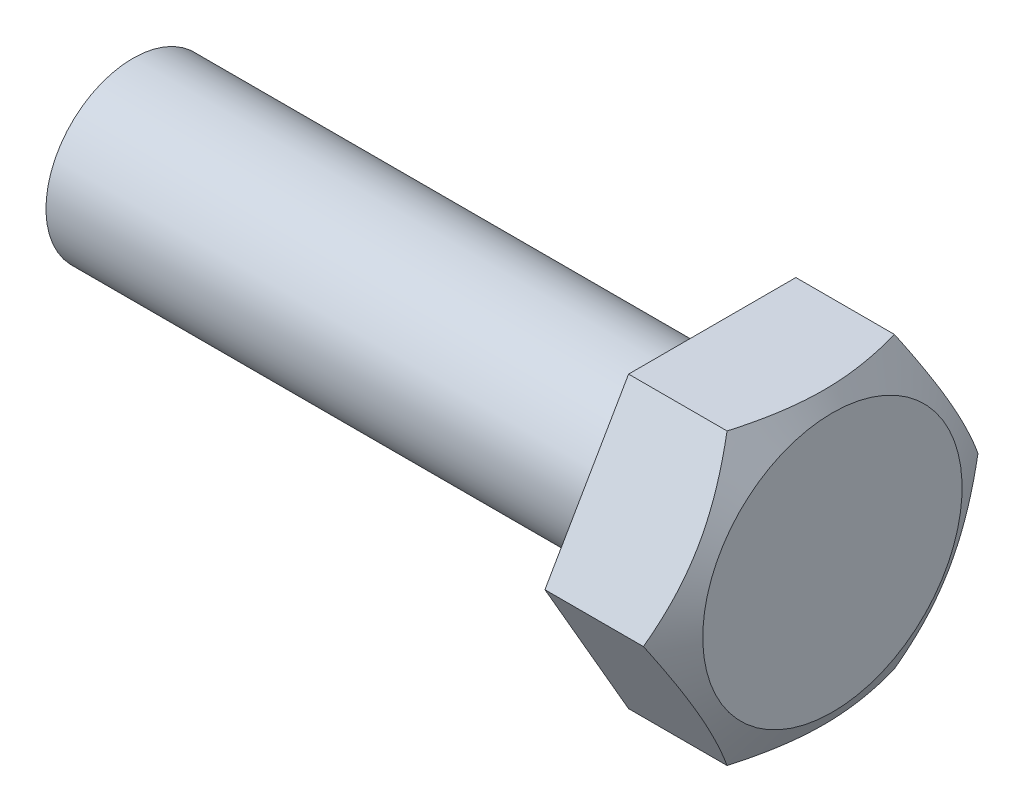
ISO-10303-21;
HEADER;
FILE_DESCRIPTION(('STEP AP214'),'2;1');
FILE_NAME('part.step','',(''),(''),'','','');
FILE_SCHEMA(('AUTOMOTIVE_DESIGN { 1 0 10303 214 1 1 1 1 }'));
ENDSEC;
DATA;
#1=APPLICATION_CONTEXT('core data for automotive mechanical design processes');
#2=APPLICATION_PROTOCOL_DEFINITION('international standard','automotive_design',2000,#1);
#3=PRODUCT_CONTEXT('',#1,'mechanical');
#4=PRODUCT('Part','Part','',(#3));
#5=PRODUCT_RELATED_PRODUCT_CATEGORY('part','',(#4));
#6=PRODUCT_DEFINITION_FORMATION('','',#4);
#7=PRODUCT_DEFINITION_CONTEXT('part definition',#1,'design');
#8=PRODUCT_DEFINITION('design','',#6,#7);
#9=PRODUCT_DEFINITION_SHAPE('','',#8);
#10=(LENGTH_UNIT() NAMED_UNIT(*) SI_UNIT(.MILLI.,.METRE.));
#11=(NAMED_UNIT(*) PLANE_ANGLE_UNIT() SI_UNIT($,.RADIAN.));
#12=(NAMED_UNIT(*) SI_UNIT($,.STERADIAN.) SOLID_ANGLE_UNIT());
#13=UNCERTAINTY_MEASURE_WITH_UNIT(LENGTH_MEASURE(1.E-05),#10,'distance_accuracy_value','');
#14=(GEOMETRIC_REPRESENTATION_CONTEXT(3) GLOBAL_UNCERTAINTY_ASSIGNED_CONTEXT((#13)) GLOBAL_UNIT_ASSIGNED_CONTEXT((#10,
#11,#12)) REPRESENTATION_CONTEXT('',''));
#15=CARTESIAN_POINT('',(0.,0.,0.));
#16=DIRECTION('',(0.,0.,1.));
#17=DIRECTION('',(1.,0.,0.));
#18=AXIS2_PLACEMENT_3D('',#15,#16,#17);
#19=CARTESIAN_POINT('',(20.,2.99999999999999,0.));
#20=DIRECTION('',(-1.,0.,0.));
#21=DIRECTION('',(0.,-1.,0.));
#22=AXIS2_PLACEMENT_3D('',#19,#20,#21);
#23=PLANE('',#22);
#24=CARTESIAN_POINT('',(20.,0.,0.));
#25=DIRECTION('',(1.,0.,0.));
#26=DIRECTION('',(0.,1.,0.));
#27=AXIS2_PLACEMENT_3D('',#24,#25,#26);
#28=CIRCLE('',#27,3.);
#29=CARTESIAN_POINT('',(20.,2.99999999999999,0.));
#30=VERTEX_POINT('',#29);
#31=EDGE_CURVE('E515',#30,#30,#28,.T.);
#32=ORIENTED_EDGE('',*,*,#31,.T.);
#33=EDGE_LOOP('',(#32));
#34=FACE_BOUND('',#33,.T.);
#35=DIRECTION('',(0.,-0.866025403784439,0.5));
#36=VECTOR('',#35,1.);
#37=CARTESIAN_POINT('',(20.,-0.250648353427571,-5.63028810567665));
#38=LINE('',#37,#36);
#39=CARTESIAN_POINT('',(20.,0.,-5.775));
#40=VERTEX_POINT('',#39);
#41=CARTESIAN_POINT('',(20.,-5.00129670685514,-2.88749999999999));
#42=VERTEX_POINT('',#41);
#43=EDGE_CURVE('E441',#40,#42,#38,.T.);
#44=ORIENTED_EDGE('',*,*,#43,.T.);
#45=DIRECTION('',(0.,0.,1.));
#46=VECTOR('',#45,1.);
#47=CARTESIAN_POINT('',(20.,-5.00129670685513,0.));
#48=LINE('',#47,#46);
#49=CARTESIAN_POINT('',(20.,-5.00129670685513,2.8875));
#50=VERTEX_POINT('',#49);
#51=EDGE_CURVE('E12',#42,#50,#48,.T.);
#52=ORIENTED_EDGE('',*,*,#51,.T.);
#53=DIRECTION('',(0.,0.866025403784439,0.5));
#54=VECTOR('',#53,1.);
#55=CARTESIAN_POINT('',(20.,-0.250648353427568,5.63028810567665));
#56=LINE('',#55,#54);
#57=CARTESIAN_POINT('',(20.,0.,5.775));
#58=VERTEX_POINT('',#57);
#59=EDGE_CURVE('E399',#50,#58,#56,.T.);
#60=ORIENTED_EDGE('',*,*,#59,.T.);
#61=DIRECTION('',(0.,0.866025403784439,-0.5));
#62=VECTOR('',#61,1.);
#63=CARTESIAN_POINT('',(20.,4.75064835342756,3.03221189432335));
#64=LINE('',#63,#62);
#65=CARTESIAN_POINT('',(20.,5.00129670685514,2.8875));
#66=VERTEX_POINT('',#65);
#67=EDGE_CURVE('E461',#58,#66,#64,.T.);
#68=ORIENTED_EDGE('',*,*,#67,.T.);
#69=DIRECTION('',(0.,0.,-1.));
#70=VECTOR('',#69,1.);
#71=CARTESIAN_POINT('',(20.,5.00129670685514,0.));
#72=LINE('',#71,#70);
#73=CARTESIAN_POINT('',(20.,5.00129670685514,-2.8875));
#74=VERTEX_POINT('',#73);
#75=EDGE_CURVE('E459',#66,#74,#72,.T.);
#76=ORIENTED_EDGE('',*,*,#75,.T.);
#77=DIRECTION('',(0.,-0.866025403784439,-0.5));
#78=VECTOR('',#77,1.);
#79=CARTESIAN_POINT('',(20.,4.75064835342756,-3.03221189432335));
#80=LINE('',#79,#78);
#81=EDGE_CURVE('E445',#74,#40,#80,.T.);
#82=ORIENTED_EDGE('',*,*,#81,.T.);
#83=EDGE_LOOP('',(#44,#52,#60,#68,#76,#82));
#84=FACE_BOUND('',#83,.T.);
#85=ADVANCED_FACE('F390',(#34,#84),#23,.T.);
#86=CARTESIAN_POINT('',(0.,0.,0.));
#87=DIRECTION('',(-1.,0.,0.));
#88=DIRECTION('',(0.,-1.,0.));
#89=AXIS2_PLACEMENT_3D('',#86,#87,#88);
#90=PLANE('',#89);
#91=CARTESIAN_POINT('',(0.,0.,0.));
#92=DIRECTION('',(1.,0.,0.));
#93=DIRECTION('',(0.,1.,0.));
#94=AXIS2_PLACEMENT_3D('',#91,#92,#93);
#95=CIRCLE('',#94,3.);
#96=CARTESIAN_POINT('',(0.,2.99999999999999,0.));
#97=VERTEX_POINT('',#96);
#98=EDGE_CURVE('E524',#97,#97,#95,.T.);
#99=ORIENTED_EDGE('',*,*,#98,.F.);
#100=EDGE_LOOP('',(#99));
#101=FACE_BOUND('',#100,.T.);
#102=ADVANCED_FACE('F556',(#101),#90,.T.);
#103=CARTESIAN_POINT('',(64.0534023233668,0.,0.));
#104=DIRECTION('',(1.,0.,0.));
#105=DIRECTION('',(0.,1.,0.));
#106=AXIS2_PLACEMENT_3D('',#103,#104,#105);
#107=CYLINDRICAL_SURFACE('',#106,3.);
#108=ORIENTED_EDGE('',*,*,#98,.T.);
#109=EDGE_LOOP('',(#108));
#110=FACE_BOUND('',#109,.T.);
#111=ORIENTED_EDGE('',*,*,#31,.F.);
#112=EDGE_LOOP('',(#111));
#113=FACE_BOUND('',#112,.T.);
#114=ADVANCED_FACE('F507',(#110,#113),#107,.T.);
#115=CARTESIAN_POINT('',(17.3428,-5.00129670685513,2.8875));
#116=DIRECTION('',(0.,-1.,0.));
#117=DIRECTION('',(0.,0.,-1.));
#118=AXIS2_PLACEMENT_3D('',#115,#116,#117);
#119=PLANE('',#118);
#120=DIRECTION('',(1.,0.,0.));
#121=VECTOR('',#120,1.);
#122=CARTESIAN_POINT('',(17.3428,-5.00129670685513,2.8875));
#123=LINE('',#122,#121);
#124=CARTESIAN_POINT('',(23.4,-5.00129670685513,2.8875));
#125=VERTEX_POINT('',#124);
#126=EDGE_CURVE('E471',#50,#125,#123,.T.);
#127=ORIENTED_EDGE('',*,*,#126,.F.);
#128=ORIENTED_EDGE('',*,*,#51,.F.);
#129=DIRECTION('',(1.,0.,0.));
#130=VECTOR('',#129,1.);
#131=CARTESIAN_POINT('',(17.3428,-5.00129670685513,-2.8875));
#132=LINE('',#131,#130);
#133=CARTESIAN_POINT('',(23.4,-5.00129670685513,-2.8875));
#134=VERTEX_POINT('',#133);
#135=EDGE_CURVE('E411',#42,#134,#132,.T.);
#136=ORIENTED_EDGE('',*,*,#135,.T.);
#137=CARTESIAN_POINT('',(21.4737240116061,-5.00129670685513,-7.6160872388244));
#138=CARTESIAN_POINT('',(21.5785707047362,-5.00129670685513,-7.39877070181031));
#139=CARTESIAN_POINT('',(21.6823706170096,-5.00129670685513,-7.18093993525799));
#140=CARTESIAN_POINT('',(21.8872850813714,-5.00129670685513,-6.74397588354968));
#141=CARTESIAN_POINT('',(21.9883991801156,-5.00129670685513,-6.5248423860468));
#142=CARTESIAN_POINT('',(22.1878893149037,-5.00129670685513,-6.08380103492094));
#143=CARTESIAN_POINT('',(22.2862461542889,-5.00129670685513,-5.86188446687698));
#144=CARTESIAN_POINT('',(22.4787424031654,-5.00129670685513,-5.41623629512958));
#145=CARTESIAN_POINT('',(22.572882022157,-5.00129670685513,-5.19250478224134));
#146=CARTESIAN_POINT('',(22.7585247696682,-5.00129670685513,-4.73623678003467));
#147=CARTESIAN_POINT('',(22.8498685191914,-5.00129670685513,-4.50363507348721));
#148=CARTESIAN_POINT('',(23.0252971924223,-5.00129670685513,-4.03565914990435));
#149=CARTESIAN_POINT('',(23.1093812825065,-5.00129670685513,-3.80028461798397));
#150=CARTESIAN_POINT('',(23.2679800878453,-5.00129670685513,-3.32687645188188));
#151=CARTESIAN_POINT('',(23.3425154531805,-5.00129670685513,-3.08884980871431));
#152=CARTESIAN_POINT('',(23.4795334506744,-5.00129670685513,-2.60938663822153));
#153=CARTESIAN_POINT('',(23.542020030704,-5.00129670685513,-2.36795125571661));
#154=CARTESIAN_POINT('',(23.6515306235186,-5.00129670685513,-1.8828327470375));
#155=CARTESIAN_POINT('',(23.6986321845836,-5.00129670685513,-1.63916746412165));
#156=CARTESIAN_POINT('',(23.7746117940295,-5.00129670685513,-1.14895991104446));
#157=CARTESIAN_POINT('',(23.8034912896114,-5.00129670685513,-0.90241787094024));
#158=CARTESIAN_POINT('',(23.8403434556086,-5.00129670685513,-0.410846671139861));
#159=CARTESIAN_POINT('',(23.8485737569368,-5.00129670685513,-0.165837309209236));
#160=CARTESIAN_POINT('',(23.8440998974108,-5.00129670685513,0.324005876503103));
#161=CARTESIAN_POINT('',(23.8313949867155,-5.00129670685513,0.568839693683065));
#162=CARTESIAN_POINT('',(23.7925261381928,-5.00129670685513,0.988769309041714));
#163=CARTESIAN_POINT('',(23.7710871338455,-5.00129670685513,1.16432588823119));
#164=CARTESIAN_POINT('',(23.7188586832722,-5.00129670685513,1.51405249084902));
#165=CARTESIAN_POINT('',(23.6880678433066,-5.00129670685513,1.6882223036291));
#166=CARTESIAN_POINT('',(23.5832970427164,-5.00129670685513,2.2084761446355));
#167=CARTESIAN_POINT('',(23.4969411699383,-5.00129670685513,2.55209019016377));
#168=CARTESIAN_POINT('',(23.3484847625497,-5.00129670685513,3.06574341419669));
#169=CARTESIAN_POINT('',(23.2951803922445,-5.00129670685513,3.23847506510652));
#170=CARTESIAN_POINT('',(23.1833585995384,-5.00129670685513,3.58225888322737));
#171=CARTESIAN_POINT('',(23.1248411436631,-5.00129670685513,3.75331103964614));
#172=CARTESIAN_POINT('',(23.0035050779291,-5.00129670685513,4.09379671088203));
#173=CARTESIAN_POINT('',(22.940688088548,-5.00129670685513,4.26323080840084));
#174=CARTESIAN_POINT('',(22.8114595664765,-5.00129670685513,4.60071709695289));
#175=CARTESIAN_POINT('',(22.7450480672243,-5.00129670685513,4.76876930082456));
#176=CARTESIAN_POINT('',(22.5902086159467,-5.00129670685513,5.15056016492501));
#177=CARTESIAN_POINT('',(22.500824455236,-5.00129670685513,5.3639101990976));
#178=CARTESIAN_POINT('',(22.3181437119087,-5.00129670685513,5.78893294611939));
#179=CARTESIAN_POINT('',(22.2248469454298,-5.00129670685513,6.00060557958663));
#180=CARTESIAN_POINT('',(22.0350910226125,-5.00129670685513,6.42256637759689));
#181=CARTESIAN_POINT('',(21.9386313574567,-5.00129670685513,6.63285431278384));
#182=CARTESIAN_POINT('',(21.7431477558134,-5.00129670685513,7.05223656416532));
#183=CARTESIAN_POINT('',(21.6441237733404,-5.00129670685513,7.26133085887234));
#184=CARTESIAN_POINT('',(21.3437507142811,-5.00129670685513,7.88746059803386));
#185=CARTESIAN_POINT('',(21.1392616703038,-5.00129670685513,8.30298898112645));
#186=CARTESIAN_POINT('',(20.7245178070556,-5.00129670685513,9.13115773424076));
#187=CARTESIAN_POINT('',(20.51426280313,-5.00129670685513,9.54379801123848));
#188=CARTESIAN_POINT('',(20.2040141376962,-5.00129670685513,10.1451524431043));
#189=CARTESIAN_POINT('',(20.1056567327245,-5.00129670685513,10.3347131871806));
#190=CARTESIAN_POINT('',(19.9081713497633,-5.00129670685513,10.7134289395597));
#191=CARTESIAN_POINT('',(19.8090433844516,-5.00129670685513,10.9025839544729));
#192=CARTESIAN_POINT('',(19.5106485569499,-5.00129670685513,11.4695336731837));
#193=CARTESIAN_POINT('',(19.3103775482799,-5.00129670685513,11.846799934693));
#194=CARTESIAN_POINT('',(18.908211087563,-5.00129670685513,12.5994260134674));
#195=CARTESIAN_POINT('',(18.7063200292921,-5.00129670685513,12.9747881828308));
#196=CARTESIAN_POINT('',(18.30091151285,-5.00129670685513,13.7246105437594));
#197=CARTESIAN_POINT('',(18.0973941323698,-5.00129670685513,14.0990707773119));
#198=CARTESIAN_POINT('',(17.8932640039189,-5.00129670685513,14.473194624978));
#199=B_SPLINE_CURVE_WITH_KNOTS('',3,(#137,#138,#139,#140,#141,#142,#143,#144,#145,#146,#147,
#148,#149,#150,#151,#152,#153,#154,#155,#156,#157,#158,#159,#160,#161,#162,#163,#164,#165,#166,
#167,#168,#169,#170,#171,#172,#173,#174,#175,#176,#177,#178,#179,#180,#181,#182,#183,#184,#185,
#186,#187,#188,#189,#190,#191,#192,#193,#194,#195,#196,#197,#198),.UNSPECIFIED.,.F.,.F.,(4,2,2,
2,2,2,2,2,2,2,2,2,2,2,2,2,2,2,2,2,2,2,2,2,2,2,2,2,2,2,4),(0.,0.723869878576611,1.44786117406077,
2.17603576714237,2.90417414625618,3.65376392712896,4.40343966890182,5.15146576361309,
5.89924634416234,6.64319738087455,7.38708932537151,8.12165284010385,8.85624266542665,
9.38656506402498,9.91696653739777,10.9784132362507,11.5206798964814,12.062950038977,
12.6050169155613,13.1470787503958,13.8409799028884,14.5349137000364,15.2289596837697,
15.9230181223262,17.3123013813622,18.7016291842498,19.3423047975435,19.9829698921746,
21.2643443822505,22.5429765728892,23.8215480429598),.UNSPECIFIED.);
#200=EDGE_CURVE('E478',#125,#134,#199,.F.);
#201=ORIENTED_EDGE('',*,*,#200,.F.);
#202=EDGE_LOOP('',(#127,#128,#136,#201));
#203=FACE_BOUND('',#202,.T.);
#204=ADVANCED_FACE('F476',(#203),#119,.T.);
#205=CARTESIAN_POINT('',(17.3428,0.,5.775));
#206=DIRECTION('',(0.,-0.5,0.866025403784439));
#207=DIRECTION('',(0.,-0.866025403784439,-0.5));
#208=AXIS2_PLACEMENT_3D('',#205,#206,#207);
#209=PLANE('',#208);
#210=DIRECTION('',(1.,0.,0.));
#211=VECTOR('',#210,1.);
#212=CARTESIAN_POINT('',(17.3428,0.,5.775));
#213=LINE('',#212,#211);
#214=CARTESIAN_POINT('',(23.4,0.,5.775));
#215=VERTEX_POINT('',#214);
#216=EDGE_CURVE('E474',#58,#215,#213,.T.);
#217=ORIENTED_EDGE('',*,*,#216,.F.);
#218=ORIENTED_EDGE('',*,*,#59,.F.);
#219=ORIENTED_EDGE('',*,*,#126,.T.);
#220=CARTESIAN_POINT('',(23.3999333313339,0.000200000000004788,5.77511547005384));
#221=CARTESIAN_POINT('',(23.4732144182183,-0.219591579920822,5.64821874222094));
#222=CARTESIAN_POINT('',(23.5398669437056,-0.441263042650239,5.52023666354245));
#223=CARTESIAN_POINT('',(23.6562094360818,-0.888444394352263,5.26205638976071));
#224=CARTESIAN_POINT('',(23.7058582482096,-1.113962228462,5.13185360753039));
#225=CARTESIAN_POINT('',(23.7831303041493,-1.56223739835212,4.8730418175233));
#226=CARTESIAN_POINT('',(23.811268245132,-1.7849249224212,4.74447311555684));
#227=CARTESIAN_POINT('',(23.8365002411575,-2.11973953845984,4.55116780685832));
#228=CARTESIAN_POINT('',(23.8420831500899,-2.23142078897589,4.48668860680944));
#229=CARTESIAN_POINT('',(23.8474957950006,-2.45488650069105,4.35767061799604));
#230=CARTESIAN_POINT('',(23.8473257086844,-2.56667095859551,4.29313183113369));
#231=CARTESIAN_POINT('',(23.8389421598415,-2.87292913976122,4.11631358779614));
#232=CARTESIAN_POINT('',(23.8248623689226,-3.0673013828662,4.00409272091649));
#233=CARTESIAN_POINT('',(23.7802153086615,-3.45475584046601,3.78039578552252));
#234=CARTESIAN_POINT('',(23.7496327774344,-3.64783669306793,3.66892050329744));
#235=CARTESIAN_POINT('',(23.6731843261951,-4.03607177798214,3.44477287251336));
#236=CARTESIAN_POINT('',(23.6269944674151,-4.23117701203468,3.33212881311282));
#237=CARTESIAN_POINT('',(23.522161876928,-4.61847776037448,3.10852062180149));
#238=CARTESIAN_POINT('',(23.4635437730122,-4.81067823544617,2.99755362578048));
#239=CARTESIAN_POINT('',(23.3999333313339,-5.00149670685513,2.88738452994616));
#240=B_SPLINE_CURVE_WITH_KNOTS('',3,(#220,#221,#222,#223,#224,#225,#226,#227,#228,#229,#230,
#231,#232,#233,#234,#235,#236,#237,#238,#239),.UNSPECIFIED.,.F.,.F.,(4,2,2,2,2,2,2,2,2,4),(0.,
0.792761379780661,1.58742817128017,2.36242787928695,2.74955363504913,3.13666743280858,
3.81061157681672,4.48518006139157,5.17471039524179,5.86288691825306),.UNSPECIFIED.);
#241=EDGE_CURVE('E516',#215,#125,#240,.T.);
#242=ORIENTED_EDGE('',*,*,#241,.F.);
#243=EDGE_LOOP('',(#217,#218,#219,#242));
#244=FACE_BOUND('',#243,.T.);
#245=ADVANCED_FACE('F470',(#244),#209,.T.);
#246=CARTESIAN_POINT('',(17.3428,5.00129670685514,2.8875));
#247=DIRECTION('',(0.,0.5,0.866025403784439));
#248=DIRECTION('',(0.,-0.866025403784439,0.5));
#249=AXIS2_PLACEMENT_3D('',#246,#247,#248);
#250=PLANE('',#249);
#251=DIRECTION('',(1.,0.,0.));
#252=VECTOR('',#251,1.);
#253=CARTESIAN_POINT('',(17.3428,5.00129670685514,2.8875));
#254=LINE('',#253,#252);
#255=CARTESIAN_POINT('',(23.4,5.00129670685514,2.8875));
#256=VERTEX_POINT('',#255);
#257=EDGE_CURVE('E482',#66,#256,#254,.T.);
#258=ORIENTED_EDGE('',*,*,#257,.F.);
#259=ORIENTED_EDGE('',*,*,#67,.F.);
#260=ORIENTED_EDGE('',*,*,#216,.T.);
#261=CARTESIAN_POINT('',(23.3999333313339,5.00149670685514,2.88738452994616));
#262=CARTESIAN_POINT('',(23.4732144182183,4.78170512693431,3.01428125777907));
#263=CARTESIAN_POINT('',(23.5398669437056,4.56003366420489,3.14226333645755));
#264=CARTESIAN_POINT('',(23.6562094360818,4.11285231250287,3.4004436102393));
#265=CARTESIAN_POINT('',(23.7058582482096,3.88733447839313,3.53064639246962));
#266=CARTESIAN_POINT('',(23.7831303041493,3.43905930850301,3.7894581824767));
#267=CARTESIAN_POINT('',(23.811268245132,3.21637178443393,3.91802688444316));
#268=CARTESIAN_POINT('',(23.8365002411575,2.88155716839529,4.11133219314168));
#269=CARTESIAN_POINT('',(23.8420831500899,2.76987591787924,4.17581139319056));
#270=CARTESIAN_POINT('',(23.8474957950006,2.54641020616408,4.30482938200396));
#271=CARTESIAN_POINT('',(23.8473257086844,2.43462574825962,4.36936816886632));
#272=CARTESIAN_POINT('',(23.8389421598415,2.12836756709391,4.54618641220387));
#273=CARTESIAN_POINT('',(23.8248623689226,1.93399532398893,4.65840727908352));
#274=CARTESIAN_POINT('',(23.7802153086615,1.54654086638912,4.88210421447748));
#275=CARTESIAN_POINT('',(23.7496327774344,1.3534600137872,4.99357949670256));
#276=CARTESIAN_POINT('',(23.6731843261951,0.965224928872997,5.21772712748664));
#277=CARTESIAN_POINT('',(23.6269944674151,0.770119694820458,5.33037118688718));
#278=CARTESIAN_POINT('',(23.522161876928,0.382818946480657,5.55397937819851));
#279=CARTESIAN_POINT('',(23.4635437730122,0.190618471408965,5.66494637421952));
#280=CARTESIAN_POINT('',(23.3999333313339,-0.00019999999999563,5.77511547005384));
#281=B_SPLINE_CURVE_WITH_KNOTS('',3,(#261,#262,#263,#264,#265,#266,#267,#268,#269,#270,#271,
#272,#273,#274,#275,#276,#277,#278,#279,#280),.UNSPECIFIED.,.F.,.F.,(4,2,2,2,2,2,2,2,2,4),(0.,
0.792761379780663,1.58742817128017,2.36242787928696,2.74955363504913,3.13666743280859,
3.81061157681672,4.48518006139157,5.17471039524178,5.86288691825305),.UNSPECIFIED.);
#282=EDGE_CURVE('E534',#256,#215,#281,.T.);
#283=ORIENTED_EDGE('',*,*,#282,.F.);
#284=EDGE_LOOP('',(#258,#259,#260,#283));
#285=FACE_BOUND('',#284,.T.);
#286=ADVANCED_FACE('F543',(#285),#250,.T.);
#287=CARTESIAN_POINT('',(17.3428,5.00129670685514,-2.8875));
#288=DIRECTION('',(0.,1.,0.));
#289=DIRECTION('',(0.,0.,1.));
#290=AXIS2_PLACEMENT_3D('',#287,#288,#289);
#291=PLANE('',#290);
#292=DIRECTION('',(1.,0.,0.));
#293=VECTOR('',#292,1.);
#294=CARTESIAN_POINT('',(17.3428,5.00129670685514,-2.8875));
#295=LINE('',#294,#293);
#296=CARTESIAN_POINT('',(23.4,5.00129670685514,-2.8875));
#297=VERTEX_POINT('',#296);
#298=EDGE_CURVE('E455',#74,#297,#295,.T.);
#299=ORIENTED_EDGE('',*,*,#298,.F.);
#300=ORIENTED_EDGE('',*,*,#75,.F.);
#301=ORIENTED_EDGE('',*,*,#257,.T.);
#302=CARTESIAN_POINT('',(21.4737240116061,5.00129670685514,-7.61608723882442));
#303=CARTESIAN_POINT('',(21.5785707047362,5.00129670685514,-7.39877070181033));
#304=CARTESIAN_POINT('',(21.6823706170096,5.00129670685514,-7.180939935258));
#305=CARTESIAN_POINT('',(21.8872850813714,5.00129670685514,-6.7439758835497));
#306=CARTESIAN_POINT('',(21.9883991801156,5.00129670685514,-6.52484238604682));
#307=CARTESIAN_POINT('',(22.1878893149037,5.00129670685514,-6.08380103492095));
#308=CARTESIAN_POINT('',(22.2862461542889,5.00129670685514,-5.86188446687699));
#309=CARTESIAN_POINT('',(22.4787424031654,5.00129670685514,-5.41623629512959));
#310=CARTESIAN_POINT('',(22.572882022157,5.00129670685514,-5.19250478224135));
#311=CARTESIAN_POINT('',(22.7585247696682,5.00129670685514,-4.73623678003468));
#312=CARTESIAN_POINT('',(22.8498685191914,5.00129670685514,-4.50363507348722));
#313=CARTESIAN_POINT('',(23.0252971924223,5.00129670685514,-4.03565914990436));
#314=CARTESIAN_POINT('',(23.1093812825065,5.00129670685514,-3.80028461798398));
#315=CARTESIAN_POINT('',(23.2679800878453,5.00129670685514,-3.32687645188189));
#316=CARTESIAN_POINT('',(23.3425154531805,5.00129670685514,-3.08884980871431));
#317=CARTESIAN_POINT('',(23.4795334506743,5.00129670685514,-2.60938663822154));
#318=CARTESIAN_POINT('',(23.542020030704,5.00129670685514,-2.36795125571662));
#319=CARTESIAN_POINT('',(23.6515306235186,5.00129670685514,-1.8828327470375));
#320=CARTESIAN_POINT('',(23.6986321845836,5.00129670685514,-1.63916746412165));
#321=CARTESIAN_POINT('',(23.7746117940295,5.00129670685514,-1.14895991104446));
#322=CARTESIAN_POINT('',(23.8034912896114,5.00129670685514,-0.902417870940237));
#323=CARTESIAN_POINT('',(23.8403434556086,5.00129670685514,-0.410846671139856));
#324=CARTESIAN_POINT('',(23.8485737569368,5.00129670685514,-0.165837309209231));
#325=CARTESIAN_POINT('',(23.8440998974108,5.00129670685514,0.324005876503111));
#326=CARTESIAN_POINT('',(23.8313949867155,5.00129670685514,0.568839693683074));
#327=CARTESIAN_POINT('',(23.7925261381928,5.00129670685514,0.988769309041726));
#328=CARTESIAN_POINT('',(23.7710871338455,5.00129670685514,1.1643258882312));
#329=CARTESIAN_POINT('',(23.7188586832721,5.00129670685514,1.51405249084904));
#330=CARTESIAN_POINT('',(23.6880678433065,5.00129670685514,1.68822230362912));
#331=CARTESIAN_POINT('',(23.5832970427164,5.00129670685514,2.20847614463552));
#332=CARTESIAN_POINT('',(23.4969411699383,5.00129670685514,2.55209019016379));
#333=CARTESIAN_POINT('',(23.3484847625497,5.00129670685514,3.06574341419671));
#334=CARTESIAN_POINT('',(23.2951803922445,5.00129670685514,3.23847506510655));
#335=CARTESIAN_POINT('',(23.1833585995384,5.00129670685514,3.58225888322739));
#336=CARTESIAN_POINT('',(23.1248411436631,5.00129670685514,3.75331103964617));
#337=CARTESIAN_POINT('',(23.0035050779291,5.00129670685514,4.09379671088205));
#338=CARTESIAN_POINT('',(22.9406880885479,5.00129670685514,4.26323080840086));
#339=CARTESIAN_POINT('',(22.8114595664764,5.00129670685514,4.60071709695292));
#340=CARTESIAN_POINT('',(22.7450480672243,5.00129670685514,4.76876930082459));
#341=CARTESIAN_POINT('',(22.5902086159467,5.00129670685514,5.15056016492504));
#342=CARTESIAN_POINT('',(22.5008244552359,5.00129670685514,5.36391019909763));
#343=CARTESIAN_POINT('',(22.3181437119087,5.00129670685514,5.78893294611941));
#344=CARTESIAN_POINT('',(22.2248469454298,5.00129670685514,6.00060557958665));
#345=CARTESIAN_POINT('',(22.0350910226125,5.00129670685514,6.42256637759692));
#346=CARTESIAN_POINT('',(21.9386313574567,5.00129670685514,6.63285431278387));
#347=CARTESIAN_POINT('',(21.7431477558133,5.00129670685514,7.05223656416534));
#348=CARTESIAN_POINT('',(21.6441237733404,5.00129670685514,7.26133085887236));
#349=CARTESIAN_POINT('',(21.3437507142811,5.00129670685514,7.88746059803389));
#350=CARTESIAN_POINT('',(21.1392616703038,5.00129670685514,8.30298898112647));
#351=CARTESIAN_POINT('',(20.7245178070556,5.00129670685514,9.13115773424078));
#352=CARTESIAN_POINT('',(20.51426280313,5.00129670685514,9.54379801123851));
#353=CARTESIAN_POINT('',(20.2040141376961,5.00129670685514,10.1451524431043));
#354=CARTESIAN_POINT('',(20.1056567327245,5.00129670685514,10.3347131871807));
#355=CARTESIAN_POINT('',(19.9081713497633,5.00129670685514,10.7134289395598));
#356=CARTESIAN_POINT('',(19.8090433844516,5.00129670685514,10.9025839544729));
#357=CARTESIAN_POINT('',(19.5106485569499,5.00129670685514,11.4695336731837));
#358=CARTESIAN_POINT('',(19.3103775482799,5.00129670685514,11.846799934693));
#359=CARTESIAN_POINT('',(18.908211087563,5.00129670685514,12.5994260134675));
#360=CARTESIAN_POINT('',(18.706320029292,5.00129670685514,12.9747881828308));
#361=CARTESIAN_POINT('',(18.30091151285,5.00129670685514,13.7246105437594));
#362=CARTESIAN_POINT('',(18.0973941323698,5.00129670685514,14.0990707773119));
#363=CARTESIAN_POINT('',(17.8932640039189,5.00129670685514,14.473194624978));
#364=B_SPLINE_CURVE_WITH_KNOTS('',3,(#302,#303,#304,#305,#306,#307,#308,#309,#310,#311,#312,
#313,#314,#315,#316,#317,#318,#319,#320,#321,#322,#323,#324,#325,#326,#327,#328,#329,#330,#331,
#332,#333,#334,#335,#336,#337,#338,#339,#340,#341,#342,#343,#344,#345,#346,#347,#348,#349,#350,
#351,#352,#353,#354,#355,#356,#357,#358,#359,#360,#361,#362,#363),.UNSPECIFIED.,.F.,.F.,(4,2,2,
2,2,2,2,2,2,2,2,2,2,2,2,2,2,2,2,2,2,2,2,2,2,2,2,2,2,2,4),(0.,0.723869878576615,1.44786117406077,
2.17603576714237,2.90417414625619,3.65376392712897,4.40343966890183,5.1514657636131,
5.89924634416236,6.64319738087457,7.38708932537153,8.12165284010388,8.85624266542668,
9.38656506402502,9.91696653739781,10.9784132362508,11.5206798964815,12.0629500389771,
12.6050169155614,13.1470787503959,13.8409799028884,14.5349137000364,15.2289596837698,
15.9230181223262,17.3123013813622,18.7016291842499,19.3423047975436,19.9829698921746,
21.2643443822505,22.5429765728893,23.8215480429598),.UNSPECIFIED.);
#365=EDGE_CURVE('E535',#297,#256,#364,.T.);
#366=ORIENTED_EDGE('',*,*,#365,.F.);
#367=EDGE_LOOP('',(#299,#300,#301,#366));
#368=FACE_BOUND('',#367,.T.);
#369=ADVANCED_FACE('F546',(#368),#291,.T.);
#370=CARTESIAN_POINT('',(17.3428,0.,-5.775));
#371=DIRECTION('',(0.,0.5,-0.866025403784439));
#372=DIRECTION('',(0.,0.866025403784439,0.5));
#373=AXIS2_PLACEMENT_3D('',#370,#371,#372);
#374=PLANE('',#373);
#375=DIRECTION('',(1.,0.,0.));
#376=VECTOR('',#375,1.);
#377=CARTESIAN_POINT('',(17.3428,0.,-5.775));
#378=LINE('',#377,#376);
#379=CARTESIAN_POINT('',(23.4,0.,-5.775));
#380=VERTEX_POINT('',#379);
#381=EDGE_CURVE('E406',#40,#380,#378,.T.);
#382=ORIENTED_EDGE('',*,*,#381,.F.);
#383=ORIENTED_EDGE('',*,*,#81,.F.);
#384=ORIENTED_EDGE('',*,*,#298,.T.);
#385=CARTESIAN_POINT('',(23.3999333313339,-0.000199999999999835,-5.77511547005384));
#386=CARTESIAN_POINT('',(23.4732144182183,0.219591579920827,-5.64821874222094));
#387=CARTESIAN_POINT('',(23.5398669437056,0.441263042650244,-5.52023666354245));
#388=CARTESIAN_POINT('',(23.6562094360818,0.888444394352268,-5.2620563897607));
#389=CARTESIAN_POINT('',(23.7058582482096,1.11396222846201,-5.13185360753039));
#390=CARTESIAN_POINT('',(23.7831303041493,1.56223739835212,-4.8730418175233));
#391=CARTESIAN_POINT('',(23.811268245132,1.78492492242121,-4.74447311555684));
#392=CARTESIAN_POINT('',(23.8365002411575,2.11973953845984,-4.55116780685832));
#393=CARTESIAN_POINT('',(23.8420831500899,2.23142078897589,-4.48668860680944));
#394=CARTESIAN_POINT('',(23.8474957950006,2.45488650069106,-4.35767061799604));
#395=CARTESIAN_POINT('',(23.8473257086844,2.56667095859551,-4.29313183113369));
#396=CARTESIAN_POINT('',(23.8389421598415,2.87292913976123,-4.11631358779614));
#397=CARTESIAN_POINT('',(23.8248623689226,3.06730138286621,-4.00409272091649));
#398=CARTESIAN_POINT('',(23.7802153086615,3.45475584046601,-3.78039578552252));
#399=CARTESIAN_POINT('',(23.7496327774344,3.64783669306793,-3.66892050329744));
#400=CARTESIAN_POINT('',(23.6731843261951,4.03607177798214,-3.44477287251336));
#401=CARTESIAN_POINT('',(23.6269944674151,4.23117701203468,-3.33212881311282));
#402=CARTESIAN_POINT('',(23.522161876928,4.61847776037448,-3.10852062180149));
#403=CARTESIAN_POINT('',(23.4635437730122,4.81067823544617,-2.99755362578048));
#404=CARTESIAN_POINT('',(23.3999333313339,5.00149670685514,-2.88738452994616));
#405=B_SPLINE_CURVE_WITH_KNOTS('',3,(#385,#386,#387,#388,#389,#390,#391,#392,#393,#394,#395,
#396,#397,#398,#399,#400,#401,#402,#403,#404),.UNSPECIFIED.,.F.,.F.,(4,2,2,2,2,2,2,2,2,4),(0.,
0.792761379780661,1.58742817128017,2.36242787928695,2.74955363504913,3.13666743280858,
3.81061157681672,4.48518006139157,5.17471039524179,5.86288691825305),.UNSPECIFIED.);
#406=EDGE_CURVE('E453',#380,#297,#405,.T.);
#407=ORIENTED_EDGE('',*,*,#406,.F.);
#408=EDGE_LOOP('',(#382,#383,#384,#407));
#409=FACE_BOUND('',#408,.T.);
#410=ADVANCED_FACE('F449',(#409),#374,.T.);
#411=CARTESIAN_POINT('',(17.3428,-5.00129670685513,-2.8875));
#412=DIRECTION('',(0.,-0.5,-0.866025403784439));
#413=DIRECTION('',(0.,0.866025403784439,-0.5));
#414=AXIS2_PLACEMENT_3D('',#411,#412,#413);
#415=PLANE('',#414);
#416=ORIENTED_EDGE('',*,*,#135,.F.);
#417=ORIENTED_EDGE('',*,*,#43,.F.);
#418=ORIENTED_EDGE('',*,*,#381,.T.);
#419=CARTESIAN_POINT('',(23.3999333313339,-5.00149670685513,-2.88738452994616));
#420=CARTESIAN_POINT('',(23.4732144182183,-4.7817051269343,-3.01428125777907));
#421=CARTESIAN_POINT('',(23.5398669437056,-4.56003366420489,-3.14226333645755));
#422=CARTESIAN_POINT('',(23.6562094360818,-4.11285231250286,-3.4004436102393));
#423=CARTESIAN_POINT('',(23.7058582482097,-3.88733447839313,-3.53064639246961));
#424=CARTESIAN_POINT('',(23.7831303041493,-3.43905930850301,-3.7894581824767));
#425=CARTESIAN_POINT('',(23.811268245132,-3.21637178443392,-3.91802688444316));
#426=CARTESIAN_POINT('',(23.8365002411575,-2.88155716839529,-4.11133219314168));
#427=CARTESIAN_POINT('',(23.8420831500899,-2.76987591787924,-4.17581139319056));
#428=CARTESIAN_POINT('',(23.8474957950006,-2.54641020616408,-4.30482938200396));
#429=CARTESIAN_POINT('',(23.8473257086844,-2.43462574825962,-4.36936816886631));
#430=CARTESIAN_POINT('',(23.8389421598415,-2.12836756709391,-4.54618641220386));
#431=CARTESIAN_POINT('',(23.8248623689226,-1.93399532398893,-4.65840727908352));
#432=CARTESIAN_POINT('',(23.7802153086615,-1.54654086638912,-4.88210421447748));
#433=CARTESIAN_POINT('',(23.7496327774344,-1.3534600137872,-4.99357949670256));
#434=CARTESIAN_POINT('',(23.6731843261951,-0.965224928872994,-5.21772712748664));
#435=CARTESIAN_POINT('',(23.6269944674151,-0.770119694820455,-5.33037118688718));
#436=CARTESIAN_POINT('',(23.522161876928,-0.382818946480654,-5.55397937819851));
#437=CARTESIAN_POINT('',(23.4635437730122,-0.190618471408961,-5.66494637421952));
#438=CARTESIAN_POINT('',(23.3999333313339,0.000200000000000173,-5.77511547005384));
#439=B_SPLINE_CURVE_WITH_KNOTS('',3,(#419,#420,#421,#422,#423,#424,#425,#426,#427,#428,#429,
#430,#431,#432,#433,#434,#435,#436,#437,#438),.UNSPECIFIED.,.F.,.F.,(4,2,2,2,2,2,2,2,2,4),(0.,
0.792761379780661,1.58742817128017,2.36242787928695,2.74955363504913,3.13666743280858,
3.81061157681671,4.48518006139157,5.17471039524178,5.86288691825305),.UNSPECIFIED.);
#440=EDGE_CURVE('E479',#134,#380,#439,.T.);
#441=ORIENTED_EDGE('',*,*,#440,.F.);
#442=EDGE_LOOP('',(#416,#417,#418,#441));
#443=FACE_BOUND('',#442,.T.);
#444=ADVANCED_FACE('F442',(#443),#415,.T.);
#445=CARTESIAN_POINT('',(24.15,0.,0.));
#446=DIRECTION('',(1.,0.,0.));
#447=DIRECTION('',(0.,1.,0.));
#448=AXIS2_PLACEMENT_3D('',#445,#446,#447);
#449=PLANE('',#448);
#450=CARTESIAN_POINT('',(24.15,0.,0.));
#451=DIRECTION('',(1.,0.,0.));
#452=DIRECTION('',(0.,1.,0.));
#453=AXIS2_PLACEMENT_3D('',#450,#451,#452);
#454=CIRCLE('',#453,4.47596189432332);
#455=CARTESIAN_POINT('',(24.15,4.47596189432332,0.));
#456=VERTEX_POINT('',#455);
#457=EDGE_CURVE('E446',#456,#456,#454,.T.);
#458=ORIENTED_EDGE('',*,*,#457,.T.);
#459=EDGE_LOOP('',(#458));
#460=FACE_BOUND('',#459,.T.);
#461=ADVANCED_FACE('F501',(#460),#449,.T.);
#462=CARTESIAN_POINT('',(24.15,0.,0.));
#463=DIRECTION('',(-1.,0.,0.));
#464=DIRECTION('',(0.,-1.,0.));
#465=AXIS2_PLACEMENT_3D('',#462,#463,#464);
#466=CONICAL_SURFACE('',#465,4.47596189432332,1.0471975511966);
#467=ORIENTED_EDGE('',*,*,#457,.F.);
#468=EDGE_LOOP('',(#467));
#469=FACE_BOUND('',#468,.T.);
#470=ORIENTED_EDGE('',*,*,#241,.T.);
#471=ORIENTED_EDGE('',*,*,#200,.T.);
#472=ORIENTED_EDGE('',*,*,#440,.T.);
#473=ORIENTED_EDGE('',*,*,#406,.T.);
#474=ORIENTED_EDGE('',*,*,#365,.T.);
#475=ORIENTED_EDGE('',*,*,#282,.T.);
#476=EDGE_LOOP('',(#470,#471,#472,#473,#474,#475));
#477=FACE_BOUND('',#476,.T.);
#478=ADVANCED_FACE('F392',(#469,#477),#466,.T.);
#479=CLOSED_SHELL('',(#85,#102,#114,#204,#245,#286,#369,#410,#444,#461,#478));
#480=MANIFOLD_SOLID_BREP('B2',#479);
#481=ADVANCED_BREP_SHAPE_REPRESENTATION('',(#18,#480),#14);
#482=SHAPE_DEFINITION_REPRESENTATION(#9,#481);
ENDSEC;
END-ISO-10303-21;
